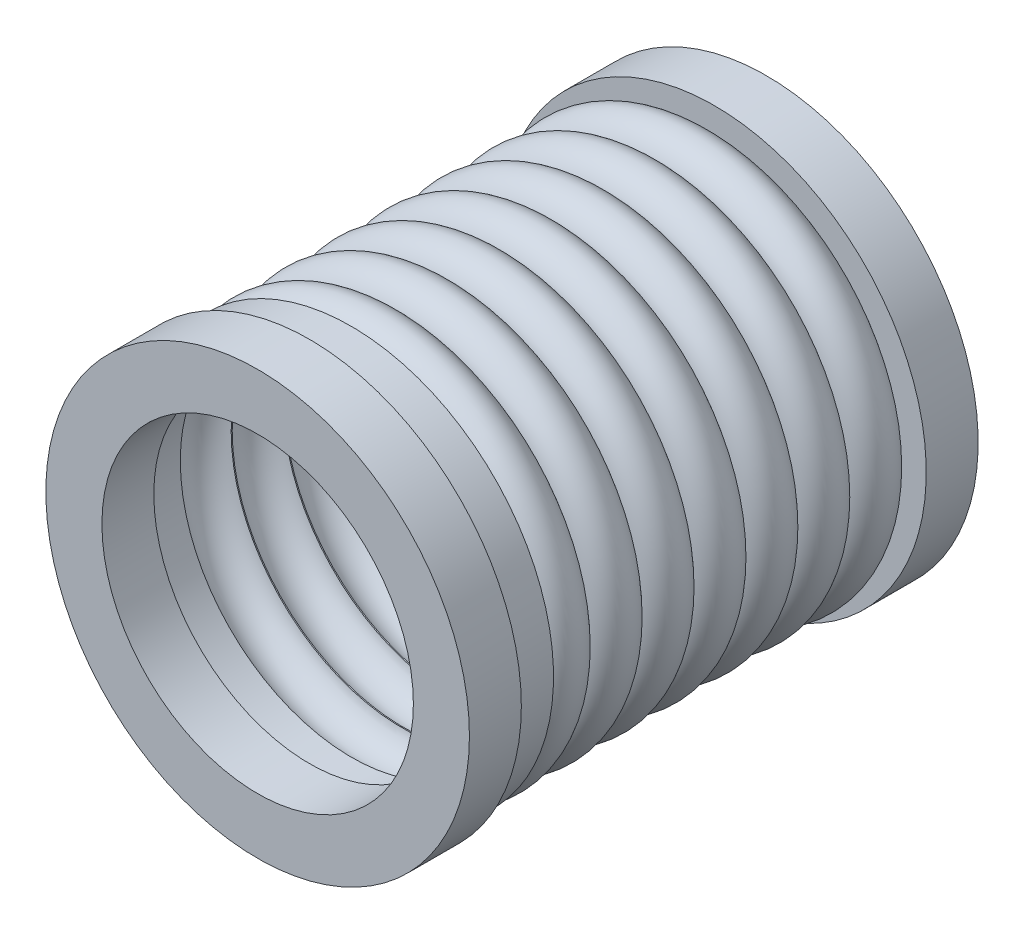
ISO-10303-21;
HEADER;
FILE_DESCRIPTION(('STEP AP214'),'2;1');
FILE_NAME('part.step','',(''),(''),'','','');
FILE_SCHEMA(('AUTOMOTIVE_DESIGN { 1 0 10303 214 1 1 1 1 }'));
ENDSEC;
DATA;
#1=APPLICATION_CONTEXT('core data for automotive mechanical design processes');
#2=APPLICATION_PROTOCOL_DEFINITION('international standard','automotive_design',2000,#1);
#3=PRODUCT_CONTEXT('',#1,'mechanical');
#4=PRODUCT('Part','Part','',(#3));
#5=PRODUCT_RELATED_PRODUCT_CATEGORY('part','',(#4));
#6=PRODUCT_DEFINITION_FORMATION('','',#4);
#7=PRODUCT_DEFINITION_CONTEXT('part definition',#1,'design');
#8=PRODUCT_DEFINITION('design','',#6,#7);
#9=PRODUCT_DEFINITION_SHAPE('','',#8);
#10=(LENGTH_UNIT() NAMED_UNIT(*) SI_UNIT(.MILLI.,.METRE.));
#11=(NAMED_UNIT(*) PLANE_ANGLE_UNIT() SI_UNIT($,.RADIAN.));
#12=(NAMED_UNIT(*) SI_UNIT($,.STERADIAN.) SOLID_ANGLE_UNIT());
#13=UNCERTAINTY_MEASURE_WITH_UNIT(LENGTH_MEASURE(1.E-05),#10,'distance_accuracy_value','');
#14=(GEOMETRIC_REPRESENTATION_CONTEXT(3) GLOBAL_UNCERTAINTY_ASSIGNED_CONTEXT((#13)) GLOBAL_UNIT_ASSIGNED_CONTEXT((#10,
#11,#12)) REPRESENTATION_CONTEXT('',''));
#15=CARTESIAN_POINT('',(0.,0.,0.));
#16=DIRECTION('',(0.,0.,1.));
#17=DIRECTION('',(1.,0.,0.));
#18=AXIS2_PLACEMENT_3D('',#15,#16,#17);
#19=CARTESIAN_POINT('',(0.,0.,24.765));
#20=DIRECTION('',(0.,0.,-1.));
#21=DIRECTION('',(-1.,0.,0.));
#22=AXIS2_PLACEMENT_3D('',#19,#20,#21);
#23=CYLINDRICAL_SURFACE('',#22,10.4775);
#24=CARTESIAN_POINT('',(0.,0.,19.0179259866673));
#25=DIRECTION('',(0.,0.,-1.));
#26=DIRECTION('',(-1.,0.,0.));
#27=AXIS2_PLACEMENT_3D('',#24,#25,#26);
#28=CIRCLE('',#27,10.4775);
#29=CARTESIAN_POINT('',(-10.4775,0.,19.0179259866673));
#30=VERTEX_POINT('',#29);
#31=EDGE_CURVE('E89',#30,#30,#28,.T.);
#32=ORIENTED_EDGE('',*,*,#31,.T.);
#33=EDGE_LOOP('',(#32));
#34=FACE_BOUND('',#33,.T.);
#35=CARTESIAN_POINT('',(0.,0.,19.0820740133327));
#36=DIRECTION('',(0.,0.,1.));
#37=DIRECTION('',(1.,0.,0.));
#38=AXIS2_PLACEMENT_3D('',#35,#36,#37);
#39=CIRCLE('',#38,10.4775);
#40=CARTESIAN_POINT('',(10.4775,0.,19.0820740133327));
#41=VERTEX_POINT('',#40);
#42=EDGE_CURVE('E39',#41,#41,#39,.T.);
#43=ORIENTED_EDGE('',*,*,#42,.T.);
#44=EDGE_LOOP('',(#43));
#45=FACE_BOUND('',#44,.T.);
#46=ADVANCED_FACE('F35',(#34,#45),#23,.F.);
#47=CARTESIAN_POINT('',(0.,0.,24.765));
#48=DIRECTION('',(0.,0.,1.));
#49=DIRECTION('',(1.,0.,0.));
#50=AXIS2_PLACEMENT_3D('',#47,#48,#49);
#51=CIRCLE('',#50,10.4775);
#52=CARTESIAN_POINT('',(10.4775,0.,24.765));
#53=VERTEX_POINT('',#52);
#54=EDGE_CURVE('E435',#53,#53,#51,.T.);
#55=ORIENTED_EDGE('',*,*,#54,.T.);
#56=EDGE_LOOP('',(#55));
#57=FACE_BOUND('',#56,.T.);
#58=CARTESIAN_POINT('',(0.,0.,22.1929259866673));
#59=DIRECTION('',(0.,0.,-1.));
#60=DIRECTION('',(-1.,0.,0.));
#61=AXIS2_PLACEMENT_3D('',#58,#59,#60);
#62=CIRCLE('',#61,10.4775);
#63=CARTESIAN_POINT('',(-10.4775,0.,22.1929259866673));
#64=VERTEX_POINT('',#63);
#65=EDGE_CURVE('E93',#64,#64,#62,.T.);
#66=ORIENTED_EDGE('',*,*,#65,.T.);
#67=EDGE_LOOP('',(#66));
#68=FACE_BOUND('',#67,.T.);
#69=ADVANCED_FACE('F149',(#57,#68),#23,.F.);
#70=CARTESIAN_POINT('',(0.,0.,15.8429259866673));
#71=DIRECTION('',(0.,0.,-1.));
#72=DIRECTION('',(-1.,0.,0.));
#73=AXIS2_PLACEMENT_3D('',#70,#71,#72);
#74=CIRCLE('',#73,10.4775);
#75=CARTESIAN_POINT('',(-10.4775,0.,15.8429259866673));
#76=VERTEX_POINT('',#75);
#77=EDGE_CURVE('E83',#76,#76,#74,.T.);
#78=ORIENTED_EDGE('',*,*,#77,.T.);
#79=EDGE_LOOP('',(#78));
#80=FACE_BOUND('',#79,.T.);
#81=CARTESIAN_POINT('',(0.,0.,15.9070740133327));
#82=DIRECTION('',(0.,0.,1.));
#83=DIRECTION('',(1.,0.,0.));
#84=AXIS2_PLACEMENT_3D('',#81,#82,#83);
#85=CIRCLE('',#84,10.4775);
#86=CARTESIAN_POINT('',(10.4775,0.,15.9070740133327));
#87=VERTEX_POINT('',#86);
#88=EDGE_CURVE('E86',#87,#87,#85,.T.);
#89=ORIENTED_EDGE('',*,*,#88,.T.);
#90=EDGE_LOOP('',(#89));
#91=FACE_BOUND('',#90,.T.);
#92=ADVANCED_FACE('F154',(#80,#91),#23,.F.);
#93=CARTESIAN_POINT('',(0.,0.,12.6679259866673));
#94=DIRECTION('',(0.,0.,-1.));
#95=DIRECTION('',(-1.,0.,0.));
#96=AXIS2_PLACEMENT_3D('',#93,#94,#95);
#97=CIRCLE('',#96,10.4775);
#98=CARTESIAN_POINT('',(-10.4775,0.,12.6679259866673));
#99=VERTEX_POINT('',#98);
#100=EDGE_CURVE('E77',#99,#99,#97,.T.);
#101=ORIENTED_EDGE('',*,*,#100,.T.);
#102=EDGE_LOOP('',(#101));
#103=FACE_BOUND('',#102,.T.);
#104=CARTESIAN_POINT('',(0.,0.,12.7320740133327));
#105=DIRECTION('',(0.,0.,1.));
#106=DIRECTION('',(1.,0.,0.));
#107=AXIS2_PLACEMENT_3D('',#104,#105,#106);
#108=CIRCLE('',#107,10.4775);
#109=CARTESIAN_POINT('',(10.4775,0.,12.7320740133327));
#110=VERTEX_POINT('',#109);
#111=EDGE_CURVE('E80',#110,#110,#108,.T.);
#112=ORIENTED_EDGE('',*,*,#111,.T.);
#113=EDGE_LOOP('',(#112));
#114=FACE_BOUND('',#113,.T.);
#115=ADVANCED_FACE('F198',(#103,#114),#23,.F.);
#116=CARTESIAN_POINT('',(0.,0.,9.49292598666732));
#117=DIRECTION('',(0.,0.,-1.));
#118=DIRECTION('',(-1.,0.,0.));
#119=AXIS2_PLACEMENT_3D('',#116,#117,#118);
#120=CIRCLE('',#119,10.4775);
#121=CARTESIAN_POINT('',(-10.4775,0.,9.49292598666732));
#122=VERTEX_POINT('',#121);
#123=EDGE_CURVE('E71',#122,#122,#120,.T.);
#124=ORIENTED_EDGE('',*,*,#123,.T.);
#125=EDGE_LOOP('',(#124));
#126=FACE_BOUND('',#125,.T.);
#127=CARTESIAN_POINT('',(0.,0.,9.55707401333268));
#128=DIRECTION('',(0.,0.,1.));
#129=DIRECTION('',(1.,0.,0.));
#130=AXIS2_PLACEMENT_3D('',#127,#128,#129);
#131=CIRCLE('',#130,10.4775);
#132=CARTESIAN_POINT('',(10.4775,0.,9.55707401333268));
#133=VERTEX_POINT('',#132);
#134=EDGE_CURVE('E74',#133,#133,#131,.T.);
#135=ORIENTED_EDGE('',*,*,#134,.T.);
#136=EDGE_LOOP('',(#135));
#137=FACE_BOUND('',#136,.T.);
#138=ADVANCED_FACE('F187',(#126,#137),#23,.F.);
#139=CARTESIAN_POINT('',(0.,0.,6.31792598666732));
#140=DIRECTION('',(0.,0.,-1.));
#141=DIRECTION('',(-1.,0.,0.));
#142=AXIS2_PLACEMENT_3D('',#139,#140,#141);
#143=CIRCLE('',#142,10.4775);
#144=CARTESIAN_POINT('',(-10.4775,0.,6.31792598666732));
#145=VERTEX_POINT('',#144);
#146=EDGE_CURVE('E65',#145,#145,#143,.T.);
#147=ORIENTED_EDGE('',*,*,#146,.T.);
#148=EDGE_LOOP('',(#147));
#149=FACE_BOUND('',#148,.T.);
#150=CARTESIAN_POINT('',(0.,0.,6.38207401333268));
#151=DIRECTION('',(0.,0.,1.));
#152=DIRECTION('',(1.,0.,0.));
#153=AXIS2_PLACEMENT_3D('',#150,#151,#152);
#154=CIRCLE('',#153,10.4775);
#155=CARTESIAN_POINT('',(10.4775,0.,6.38207401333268));
#156=VERTEX_POINT('',#155);
#157=EDGE_CURVE('E68',#156,#156,#154,.T.);
#158=ORIENTED_EDGE('',*,*,#157,.T.);
#159=EDGE_LOOP('',(#158));
#160=FACE_BOUND('',#159,.T.);
#161=ADVANCED_FACE('F163',(#149,#160),#23,.F.);
#162=CARTESIAN_POINT('',(0.,0.,3.14292598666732));
#163=DIRECTION('',(0.,0.,-1.));
#164=DIRECTION('',(-1.,0.,0.));
#165=AXIS2_PLACEMENT_3D('',#162,#163,#164);
#166=CIRCLE('',#165,10.4775);
#167=CARTESIAN_POINT('',(-10.4775,0.,3.14292598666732));
#168=VERTEX_POINT('',#167);
#169=EDGE_CURVE('E57',#168,#168,#166,.T.);
#170=ORIENTED_EDGE('',*,*,#169,.T.);
#171=EDGE_LOOP('',(#170));
#172=FACE_BOUND('',#171,.T.);
#173=CARTESIAN_POINT('',(0.,0.,3.20707401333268));
#174=DIRECTION('',(0.,0.,1.));
#175=DIRECTION('',(1.,0.,0.));
#176=AXIS2_PLACEMENT_3D('',#173,#174,#175);
#177=CIRCLE('',#176,10.4775);
#178=CARTESIAN_POINT('',(10.4775,0.,3.20707401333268));
#179=VERTEX_POINT('',#178);
#180=EDGE_CURVE('E61',#179,#179,#177,.T.);
#181=ORIENTED_EDGE('',*,*,#180,.T.);
#182=EDGE_LOOP('',(#181));
#183=FACE_BOUND('',#182,.T.);
#184=ADVANCED_FACE('F158',(#172,#183),#23,.F.);
#185=CARTESIAN_POINT('',(0.,0.,0.));
#186=DIRECTION('',(0.,0.,1.));
#187=DIRECTION('',(1.,0.,0.));
#188=AXIS2_PLACEMENT_3D('',#185,#186,#187);
#189=CIRCLE('',#188,10.4775);
#190=CARTESIAN_POINT('',(10.4775,0.,0.));
#191=VERTEX_POINT('',#190);
#192=EDGE_CURVE('E43',#191,#191,#189,.T.);
#193=ORIENTED_EDGE('',*,*,#192,.F.);
#194=EDGE_LOOP('',(#193));
#195=FACE_BOUND('',#194,.T.);
#196=CARTESIAN_POINT('',(0.,0.,0.0320740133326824));
#197=DIRECTION('',(0.,0.,1.));
#198=DIRECTION('',(1.,0.,0.));
#199=AXIS2_PLACEMENT_3D('',#196,#197,#198);
#200=CIRCLE('',#199,10.4775);
#201=CARTESIAN_POINT('',(10.4775,0.,0.0320740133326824));
#202=VERTEX_POINT('',#201);
#203=EDGE_CURVE('E60',#202,#202,#200,.T.);
#204=ORIENTED_EDGE('',*,*,#203,.T.);
#205=EDGE_LOOP('',(#204));
#206=FACE_BOUND('',#205,.T.);
#207=ADVANCED_FACE('F146',(#195,#206),#23,.F.);
#208=CARTESIAN_POINT('',(0.,0.,24.765));
#209=DIRECTION('',(0.,0.,-1.));
#210=DIRECTION('',(-1.,0.,0.));
#211=AXIS2_PLACEMENT_3D('',#208,#209,#210);
#212=CYLINDRICAL_SURFACE('',#211,12.3825);
#213=CARTESIAN_POINT('',(0.,0.,24.765));
#214=DIRECTION('',(0.,0.,1.));
#215=DIRECTION('',(1.,0.,0.));
#216=AXIS2_PLACEMENT_3D('',#213,#214,#215);
#217=CIRCLE('',#216,12.3825);
#218=CARTESIAN_POINT('',(12.3825,0.,24.765));
#219=VERTEX_POINT('',#218);
#220=EDGE_CURVE('E10',#219,#219,#217,.T.);
#221=ORIENTED_EDGE('',*,*,#220,.F.);
#222=EDGE_LOOP('',(#221));
#223=FACE_BOUND('',#222,.T.);
#224=CARTESIAN_POINT('',(0.,0.,22.225));
#225=DIRECTION('',(0.,0.,-1.));
#226=DIRECTION('',(-1.,0.,0.));
#227=AXIS2_PLACEMENT_3D('',#224,#225,#226);
#228=CIRCLE('',#227,12.3825);
#229=CARTESIAN_POINT('',(-12.3825,0.,22.225));
#230=VERTEX_POINT('',#229);
#231=EDGE_CURVE('E52',#230,#230,#228,.T.);
#232=ORIENTED_EDGE('',*,*,#231,.F.);
#233=EDGE_LOOP('',(#232));
#234=FACE_BOUND('',#233,.T.);
#235=ADVANCED_FACE('F37',(#223,#234),#212,.T.);
#236=CARTESIAN_POINT('',(0.,0.,1.5875));
#237=DIRECTION('',(0.,0.,-1.));
#238=DIRECTION('',(-1.,0.,0.));
#239=AXIS2_PLACEMENT_3D('',#236,#237,#238);
#240=TOROIDAL_SURFACE('',#239,10.795,1.5875);
#241=CARTESIAN_POINT('',(0.,0.,3.175));
#242=DIRECTION('',(0.,0.,-1.));
#243=DIRECTION('',(-1.,0.,0.));
#244=AXIS2_PLACEMENT_3D('',#241,#242,#243);
#245=CIRCLE('',#244,10.795);
#246=CARTESIAN_POINT('',(-10.795,0.,3.175));
#247=VERTEX_POINT('',#246);
#248=EDGE_CURVE('E126',#247,#247,#245,.T.);
#249=ORIENTED_EDGE('',*,*,#248,.T.);
#250=EDGE_LOOP('',(#249));
#251=FACE_BOUND('',#250,.T.);
#252=CARTESIAN_POINT('',(0.,0.,0.));
#253=DIRECTION('',(0.,0.,-1.));
#254=DIRECTION('',(-1.,0.,0.));
#255=AXIS2_PLACEMENT_3D('',#252,#253,#254);
#256=CIRCLE('',#255,10.795);
#257=CARTESIAN_POINT('',(-10.795,0.,0.));
#258=VERTEX_POINT('',#257);
#259=EDGE_CURVE('E48',#258,#258,#256,.T.);
#260=ORIENTED_EDGE('',*,*,#259,.F.);
#261=EDGE_LOOP('',(#260));
#262=FACE_BOUND('',#261,.T.);
#263=ADVANCED_FACE('F134',(#251,#262),#240,.T.);
#264=CARTESIAN_POINT('',(0.,0.,4.7625));
#265=DIRECTION('',(0.,0.,-1.));
#266=DIRECTION('',(-1.,0.,0.));
#267=AXIS2_PLACEMENT_3D('',#264,#265,#266);
#268=TOROIDAL_SURFACE('',#267,10.795,1.5875);
#269=CARTESIAN_POINT('',(0.,0.,6.35));
#270=DIRECTION('',(0.,0.,-1.));
#271=DIRECTION('',(-1.,0.,0.));
#272=AXIS2_PLACEMENT_3D('',#269,#270,#271);
#273=CIRCLE('',#272,10.795);
#274=CARTESIAN_POINT('',(-10.795,0.,6.35));
#275=VERTEX_POINT('',#274);
#276=EDGE_CURVE('E123',#275,#275,#273,.T.);
#277=ORIENTED_EDGE('',*,*,#276,.T.);
#278=EDGE_LOOP('',(#277));
#279=FACE_BOUND('',#278,.T.);
#280=ORIENTED_EDGE('',*,*,#248,.F.);
#281=EDGE_LOOP('',(#280));
#282=FACE_BOUND('',#281,.T.);
#283=ADVANCED_FACE('F136',(#279,#282),#268,.T.);
#284=CARTESIAN_POINT('',(0.,0.,7.9375));
#285=DIRECTION('',(0.,0.,-1.));
#286=DIRECTION('',(-1.,0.,0.));
#287=AXIS2_PLACEMENT_3D('',#284,#285,#286);
#288=TOROIDAL_SURFACE('',#287,10.795,1.5875);
#289=CARTESIAN_POINT('',(0.,0.,9.525));
#290=DIRECTION('',(0.,0.,-1.));
#291=DIRECTION('',(-1.,0.,0.));
#292=AXIS2_PLACEMENT_3D('',#289,#290,#291);
#293=CIRCLE('',#292,10.795);
#294=CARTESIAN_POINT('',(-10.795,0.,9.525));
#295=VERTEX_POINT('',#294);
#296=EDGE_CURVE('E120',#295,#295,#293,.T.);
#297=ORIENTED_EDGE('',*,*,#296,.T.);
#298=EDGE_LOOP('',(#297));
#299=FACE_BOUND('',#298,.T.);
#300=ORIENTED_EDGE('',*,*,#276,.F.);
#301=EDGE_LOOP('',(#300));
#302=FACE_BOUND('',#301,.T.);
#303=ADVANCED_FACE('F143',(#299,#302),#288,.T.);
#304=CARTESIAN_POINT('',(0.,0.,11.1125));
#305=DIRECTION('',(0.,0.,-1.));
#306=DIRECTION('',(-1.,0.,0.));
#307=AXIS2_PLACEMENT_3D('',#304,#305,#306);
#308=TOROIDAL_SURFACE('',#307,10.795,1.5875);
#309=CARTESIAN_POINT('',(0.,0.,12.7));
#310=DIRECTION('',(0.,0.,-1.));
#311=DIRECTION('',(-1.,0.,0.));
#312=AXIS2_PLACEMENT_3D('',#309,#310,#311);
#313=CIRCLE('',#312,10.795);
#314=CARTESIAN_POINT('',(-10.795,0.,12.7));
#315=VERTEX_POINT('',#314);
#316=EDGE_CURVE('E117',#315,#315,#313,.T.);
#317=ORIENTED_EDGE('',*,*,#316,.T.);
#318=EDGE_LOOP('',(#317));
#319=FACE_BOUND('',#318,.T.);
#320=ORIENTED_EDGE('',*,*,#296,.F.);
#321=EDGE_LOOP('',(#320));
#322=FACE_BOUND('',#321,.T.);
#323=ADVANCED_FACE('F248',(#319,#322),#308,.T.);
#324=CARTESIAN_POINT('',(0.,0.,14.2875));
#325=DIRECTION('',(0.,0.,-1.));
#326=DIRECTION('',(-1.,0.,0.));
#327=AXIS2_PLACEMENT_3D('',#324,#325,#326);
#328=TOROIDAL_SURFACE('',#327,10.795,1.5875);
#329=CARTESIAN_POINT('',(0.,0.,15.875));
#330=DIRECTION('',(0.,0.,-1.));
#331=DIRECTION('',(-1.,0.,0.));
#332=AXIS2_PLACEMENT_3D('',#329,#330,#331);
#333=CIRCLE('',#332,10.795);
#334=CARTESIAN_POINT('',(-10.795,0.,15.875));
#335=VERTEX_POINT('',#334);
#336=EDGE_CURVE('E55',#335,#335,#333,.T.);
#337=ORIENTED_EDGE('',*,*,#336,.T.);
#338=EDGE_LOOP('',(#337));
#339=FACE_BOUND('',#338,.T.);
#340=ORIENTED_EDGE('',*,*,#316,.F.);
#341=EDGE_LOOP('',(#340));
#342=FACE_BOUND('',#341,.T.);
#343=ADVANCED_FACE('F244',(#339,#342),#328,.T.);
#344=CARTESIAN_POINT('',(0.,0.,17.4625));
#345=DIRECTION('',(0.,0.,-1.));
#346=DIRECTION('',(-1.,0.,0.));
#347=AXIS2_PLACEMENT_3D('',#344,#345,#346);
#348=TOROIDAL_SURFACE('',#347,10.795,1.5875);
#349=CARTESIAN_POINT('',(0.,0.,19.05));
#350=DIRECTION('',(0.,0.,-1.));
#351=DIRECTION('',(-1.,0.,0.));
#352=AXIS2_PLACEMENT_3D('',#349,#350,#351);
#353=CIRCLE('',#352,10.795);
#354=CARTESIAN_POINT('',(-10.795,0.,19.05));
#355=VERTEX_POINT('',#354);
#356=EDGE_CURVE('E64',#355,#355,#353,.T.);
#357=ORIENTED_EDGE('',*,*,#356,.T.);
#358=EDGE_LOOP('',(#357));
#359=FACE_BOUND('',#358,.T.);
#360=ORIENTED_EDGE('',*,*,#336,.F.);
#361=EDGE_LOOP('',(#360));
#362=FACE_BOUND('',#361,.T.);
#363=ADVANCED_FACE('F237',(#359,#362),#348,.T.);
#364=CARTESIAN_POINT('',(10.795,0.,22.225));
#365=DIRECTION('',(0.,0.,-1.));
#366=DIRECTION('',(-1.,0.,0.));
#367=AXIS2_PLACEMENT_3D('',#364,#365,#366);
#368=PLANE('',#367);
#369=CARTESIAN_POINT('',(0.,0.,22.225));
#370=DIRECTION('',(0.,0.,-1.));
#371=DIRECTION('',(-1.,0.,0.));
#372=AXIS2_PLACEMENT_3D('',#369,#370,#371);
#373=CIRCLE('',#372,10.795);
#374=CARTESIAN_POINT('',(-10.795,0.,22.225));
#375=VERTEX_POINT('',#374);
#376=EDGE_CURVE('E56',#375,#375,#373,.T.);
#377=ORIENTED_EDGE('',*,*,#376,.F.);
#378=EDGE_LOOP('',(#377));
#379=FACE_BOUND('',#378,.T.);
#380=ORIENTED_EDGE('',*,*,#231,.T.);
#381=EDGE_LOOP('',(#380));
#382=FACE_BOUND('',#381,.T.);
#383=ADVANCED_FACE('F234',(#379,#382),#368,.T.);
#384=CARTESIAN_POINT('',(0.,0.,20.6375));
#385=DIRECTION('',(0.,0.,-1.));
#386=DIRECTION('',(-1.,0.,0.));
#387=AXIS2_PLACEMENT_3D('',#384,#385,#386);
#388=TOROIDAL_SURFACE('',#387,10.795,1.5875);
#389=ORIENTED_EDGE('',*,*,#376,.T.);
#390=EDGE_LOOP('',(#389));
#391=FACE_BOUND('',#390,.T.);
#392=ORIENTED_EDGE('',*,*,#356,.F.);
#393=EDGE_LOOP('',(#392));
#394=FACE_BOUND('',#393,.T.);
#395=ADVANCED_FACE('F173',(#391,#394),#388,.T.);
#396=CARTESIAN_POINT('',(0.,0.,1.5875));
#397=DIRECTION('',(0.,0.,-1.));
#398=DIRECTION('',(-1.,0.,0.));
#399=AXIS2_PLACEMENT_3D('',#396,#397,#398);
#400=TOROIDAL_SURFACE('',#399,10.16,1.5875);
#401=ORIENTED_EDGE('',*,*,#203,.F.);
#402=EDGE_LOOP('',(#401));
#403=FACE_BOUND('',#402,.T.);
#404=ORIENTED_EDGE('',*,*,#169,.F.);
#405=EDGE_LOOP('',(#404));
#406=FACE_BOUND('',#405,.T.);
#407=ADVANCED_FACE('F169',(#403,#406),#400,.F.);
#408=CARTESIAN_POINT('',(0.,0.,4.7625));
#409=DIRECTION('',(0.,0.,-1.));
#410=DIRECTION('',(-1.,0.,0.));
#411=AXIS2_PLACEMENT_3D('',#408,#409,#410);
#412=TOROIDAL_SURFACE('',#411,10.16,1.5875);
#413=ORIENTED_EDGE('',*,*,#180,.F.);
#414=EDGE_LOOP('',(#413));
#415=FACE_BOUND('',#414,.T.);
#416=ORIENTED_EDGE('',*,*,#146,.F.);
#417=EDGE_LOOP('',(#416));
#418=FACE_BOUND('',#417,.T.);
#419=ADVANCED_FACE('F172',(#415,#418),#412,.F.);
#420=CARTESIAN_POINT('',(0.,0.,7.9375));
#421=DIRECTION('',(0.,0.,-1.));
#422=DIRECTION('',(-1.,0.,0.));
#423=AXIS2_PLACEMENT_3D('',#420,#421,#422);
#424=TOROIDAL_SURFACE('',#423,10.16,1.5875);
#425=ORIENTED_EDGE('',*,*,#157,.F.);
#426=EDGE_LOOP('',(#425));
#427=FACE_BOUND('',#426,.T.);
#428=ORIENTED_EDGE('',*,*,#123,.F.);
#429=EDGE_LOOP('',(#428));
#430=FACE_BOUND('',#429,.T.);
#431=ADVANCED_FACE('F181',(#427,#430),#424,.F.);
#432=CARTESIAN_POINT('',(0.,0.,11.1125));
#433=DIRECTION('',(0.,0.,-1.));
#434=DIRECTION('',(-1.,0.,0.));
#435=AXIS2_PLACEMENT_3D('',#432,#433,#434);
#436=TOROIDAL_SURFACE('',#435,10.16,1.5875);
#437=ORIENTED_EDGE('',*,*,#134,.F.);
#438=EDGE_LOOP('',(#437));
#439=FACE_BOUND('',#438,.T.);
#440=ORIENTED_EDGE('',*,*,#100,.F.);
#441=EDGE_LOOP('',(#440));
#442=FACE_BOUND('',#441,.T.);
#443=ADVANCED_FACE('F192',(#439,#442),#436,.F.);
#444=CARTESIAN_POINT('',(0.,0.,14.2875));
#445=DIRECTION('',(0.,0.,-1.));
#446=DIRECTION('',(-1.,0.,0.));
#447=AXIS2_PLACEMENT_3D('',#444,#445,#446);
#448=TOROIDAL_SURFACE('',#447,10.16,1.5875);
#449=ORIENTED_EDGE('',*,*,#111,.F.);
#450=EDGE_LOOP('',(#449));
#451=FACE_BOUND('',#450,.T.);
#452=ORIENTED_EDGE('',*,*,#77,.F.);
#453=EDGE_LOOP('',(#452));
#454=FACE_BOUND('',#453,.T.);
#455=ADVANCED_FACE('F203',(#451,#454),#448,.F.);
#456=CARTESIAN_POINT('',(0.,0.,17.4625));
#457=DIRECTION('',(0.,0.,-1.));
#458=DIRECTION('',(-1.,0.,0.));
#459=AXIS2_PLACEMENT_3D('',#456,#457,#458);
#460=TOROIDAL_SURFACE('',#459,10.16,1.5875);
#461=ORIENTED_EDGE('',*,*,#88,.F.);
#462=EDGE_LOOP('',(#461));
#463=FACE_BOUND('',#462,.T.);
#464=ORIENTED_EDGE('',*,*,#31,.F.);
#465=EDGE_LOOP('',(#464));
#466=FACE_BOUND('',#465,.T.);
#467=ADVANCED_FACE('F213',(#463,#466),#460,.F.);
#468=CARTESIAN_POINT('',(0.,0.,20.6375));
#469=DIRECTION('',(0.,0.,-1.));
#470=DIRECTION('',(-1.,0.,0.));
#471=AXIS2_PLACEMENT_3D('',#468,#469,#470);
#472=TOROIDAL_SURFACE('',#471,10.16,1.5875);
#473=ORIENTED_EDGE('',*,*,#42,.F.);
#474=EDGE_LOOP('',(#473));
#475=FACE_BOUND('',#474,.T.);
#476=ORIENTED_EDGE('',*,*,#65,.F.);
#477=EDGE_LOOP('',(#476));
#478=FACE_BOUND('',#477,.T.);
#479=ADVANCED_FACE('F223',(#475,#478),#472,.F.);
#480=CARTESIAN_POINT('',(0.,0.,0.));
#481=DIRECTION('',(0.,0.,-1.));
#482=DIRECTION('',(-1.,0.,0.));
#483=AXIS2_PLACEMENT_3D('',#480,#481,#482);
#484=PLANE('',#483);
#485=ORIENTED_EDGE('',*,*,#192,.T.);
#486=EDGE_LOOP('',(#485));
#487=FACE_BOUND('',#486,.T.);
#488=CARTESIAN_POINT('',(0.,0.,0.));
#489=DIRECTION('',(0.,0.,-1.));
#490=DIRECTION('',(-1.,0.,0.));
#491=AXIS2_PLACEMENT_3D('',#488,#489,#490);
#492=CIRCLE('',#491,9.525);
#493=CARTESIAN_POINT('',(-9.525,0.,0.));
#494=VERTEX_POINT('',#493);
#495=EDGE_CURVE('E108',#494,#494,#492,.T.);
#496=ORIENTED_EDGE('',*,*,#495,.T.);
#497=EDGE_LOOP('',(#496));
#498=FACE_BOUND('',#497,.T.);
#499=ADVANCED_FACE('F229',(#487,#498),#484,.F.);
#500=CARTESIAN_POINT('',(0.,0.,-3.175));
#501=DIRECTION('',(0.,0.,-1.));
#502=DIRECTION('',(-1.,0.,0.));
#503=AXIS2_PLACEMENT_3D('',#500,#501,#502);
#504=PLANE('',#503);
#505=CARTESIAN_POINT('',(0.,0.,-3.175));
#506=DIRECTION('',(0.,0.,-1.));
#507=DIRECTION('',(-1.,0.,0.));
#508=AXIS2_PLACEMENT_3D('',#505,#506,#507);
#509=CIRCLE('',#508,12.954);
#510=CARTESIAN_POINT('',(-12.954,0.,-3.175));
#511=VERTEX_POINT('',#510);
#512=EDGE_CURVE('E95',#511,#511,#509,.T.);
#513=ORIENTED_EDGE('',*,*,#512,.T.);
#514=EDGE_LOOP('',(#513));
#515=FACE_BOUND('',#514,.T.);
#516=CARTESIAN_POINT('',(0.,0.,-3.175));
#517=DIRECTION('',(0.,0.,-1.));
#518=DIRECTION('',(-1.,0.,0.));
#519=AXIS2_PLACEMENT_3D('',#516,#517,#518);
#520=CIRCLE('',#519,9.525);
#521=CARTESIAN_POINT('',(-9.525,0.,-3.175));
#522=VERTEX_POINT('',#521);
#523=EDGE_CURVE('E105',#522,#522,#520,.T.);
#524=ORIENTED_EDGE('',*,*,#523,.F.);
#525=EDGE_LOOP('',(#524));
#526=FACE_BOUND('',#525,.T.);
#527=ADVANCED_FACE('F332',(#515,#526),#504,.T.);
#528=ORIENTED_EDGE('',*,*,#259,.T.);
#529=EDGE_LOOP('',(#528));
#530=FACE_BOUND('',#529,.T.);
#531=CARTESIAN_POINT('',(0.,0.,0.));
#532=DIRECTION('',(0.,0.,-1.));
#533=DIRECTION('',(-1.,0.,0.));
#534=AXIS2_PLACEMENT_3D('',#531,#532,#533);
#535=CIRCLE('',#534,12.954);
#536=CARTESIAN_POINT('',(-12.954,0.,0.));
#537=VERTEX_POINT('',#536);
#538=EDGE_CURVE('E100',#537,#537,#535,.T.);
#539=ORIENTED_EDGE('',*,*,#538,.F.);
#540=EDGE_LOOP('',(#539));
#541=FACE_BOUND('',#540,.T.);
#542=ADVANCED_FACE('F131',(#530,#541),#484,.F.);
#543=CARTESIAN_POINT('',(0.,0.,-3.175));
#544=DIRECTION('',(0.,0.,1.));
#545=DIRECTION('',(1.,0.,0.));
#546=AXIS2_PLACEMENT_3D('',#543,#544,#545);
#547=CYLINDRICAL_SURFACE('',#546,12.954);
#548=ORIENTED_EDGE('',*,*,#512,.F.);
#549=EDGE_LOOP('',(#548));
#550=FACE_BOUND('',#549,.T.);
#551=ORIENTED_EDGE('',*,*,#538,.T.);
#552=EDGE_LOOP('',(#551));
#553=FACE_BOUND('',#552,.T.);
#554=ADVANCED_FACE('F350',(#550,#553),#547,.T.);
#555=CARTESIAN_POINT('',(0.,0.,-3.175));
#556=DIRECTION('',(0.,0.,1.));
#557=DIRECTION('',(1.,0.,0.));
#558=AXIS2_PLACEMENT_3D('',#555,#556,#557);
#559=CYLINDRICAL_SURFACE('',#558,9.525);
#560=ORIENTED_EDGE('',*,*,#523,.T.);
#561=EDGE_LOOP('',(#560));
#562=FACE_BOUND('',#561,.T.);
#563=ORIENTED_EDGE('',*,*,#495,.F.);
#564=EDGE_LOOP('',(#563));
#565=FACE_BOUND('',#564,.T.);
#566=ADVANCED_FACE('F358',(#562,#565),#559,.F.);
#567=CARTESIAN_POINT('',(0.,0.,24.765));
#568=DIRECTION('',(0.,0.,1.));
#569=DIRECTION('',(1.,0.,0.));
#570=AXIS2_PLACEMENT_3D('',#567,#568,#569);
#571=PLANE('',#570);
#572=CARTESIAN_POINT('',(0.,0.,24.765));
#573=DIRECTION('',(0.,0.,1.));
#574=DIRECTION('',(1.,0.,0.));
#575=AXIS2_PLACEMENT_3D('',#572,#573,#574);
#576=CIRCLE('',#575,12.954);
#577=CARTESIAN_POINT('',(12.954,0.,24.765));
#578=VERTEX_POINT('',#577);
#579=EDGE_CURVE('E429',#578,#578,#576,.T.);
#580=ORIENTED_EDGE('',*,*,#579,.F.);
#581=EDGE_LOOP('',(#580));
#582=FACE_BOUND('',#581,.T.);
#583=ORIENTED_EDGE('',*,*,#220,.T.);
#584=EDGE_LOOP('',(#583));
#585=FACE_BOUND('',#584,.T.);
#586=ADVANCED_FACE('F367',(#582,#585),#571,.F.);
#587=CARTESIAN_POINT('',(0.,0.,27.94));
#588=DIRECTION('',(0.,0.,1.));
#589=DIRECTION('',(1.,0.,0.));
#590=AXIS2_PLACEMENT_3D('',#587,#588,#589);
#591=PLANE('',#590);
#592=CARTESIAN_POINT('',(0.,0.,27.94));
#593=DIRECTION('',(0.,0.,1.));
#594=DIRECTION('',(1.,0.,0.));
#595=AXIS2_PLACEMENT_3D('',#592,#593,#594);
#596=CIRCLE('',#595,12.954);
#597=CARTESIAN_POINT('',(12.954,0.,27.94));
#598=VERTEX_POINT('',#597);
#599=EDGE_CURVE('E432',#598,#598,#596,.T.);
#600=ORIENTED_EDGE('',*,*,#599,.T.);
#601=EDGE_LOOP('',(#600));
#602=FACE_BOUND('',#601,.T.);
#603=CARTESIAN_POINT('',(0.,0.,27.94));
#604=DIRECTION('',(0.,0.,1.));
#605=DIRECTION('',(1.,0.,0.));
#606=AXIS2_PLACEMENT_3D('',#603,#604,#605);
#607=CIRCLE('',#606,9.525);
#608=CARTESIAN_POINT('',(9.525,0.,27.94));
#609=VERTEX_POINT('',#608);
#610=EDGE_CURVE('E423',#609,#609,#607,.T.);
#611=ORIENTED_EDGE('',*,*,#610,.F.);
#612=EDGE_LOOP('',(#611));
#613=FACE_BOUND('',#612,.T.);
#614=ADVANCED_FACE('F377',(#602,#613),#591,.T.);
#615=ORIENTED_EDGE('',*,*,#54,.F.);
#616=EDGE_LOOP('',(#615));
#617=FACE_BOUND('',#616,.T.);
#618=CARTESIAN_POINT('',(0.,0.,24.765));
#619=DIRECTION('',(0.,0.,1.));
#620=DIRECTION('',(1.,0.,0.));
#621=AXIS2_PLACEMENT_3D('',#618,#619,#620);
#622=CIRCLE('',#621,9.525);
#623=CARTESIAN_POINT('',(9.525,0.,24.765));
#624=VERTEX_POINT('',#623);
#625=EDGE_CURVE('E426',#624,#624,#622,.T.);
#626=ORIENTED_EDGE('',*,*,#625,.T.);
#627=EDGE_LOOP('',(#626));
#628=FACE_BOUND('',#627,.T.);
#629=ADVANCED_FACE('F380',(#617,#628),#571,.F.);
#630=CARTESIAN_POINT('',(0.,0.,27.94));
#631=DIRECTION('',(0.,0.,-1.));
#632=DIRECTION('',(-1.,0.,0.));
#633=AXIS2_PLACEMENT_3D('',#630,#631,#632);
#634=CYLINDRICAL_SURFACE('',#633,12.954);
#635=ORIENTED_EDGE('',*,*,#599,.F.);
#636=EDGE_LOOP('',(#635));
#637=FACE_BOUND('',#636,.T.);
#638=ORIENTED_EDGE('',*,*,#579,.T.);
#639=EDGE_LOOP('',(#638));
#640=FACE_BOUND('',#639,.T.);
#641=ADVANCED_FACE('F397',(#637,#640),#634,.T.);
#642=CARTESIAN_POINT('',(0.,0.,27.94));
#643=DIRECTION('',(0.,0.,-1.));
#644=DIRECTION('',(-1.,0.,0.));
#645=AXIS2_PLACEMENT_3D('',#642,#643,#644);
#646=CYLINDRICAL_SURFACE('',#645,9.525);
#647=ORIENTED_EDGE('',*,*,#610,.T.);
#648=EDGE_LOOP('',(#647));
#649=FACE_BOUND('',#648,.T.);
#650=ORIENTED_EDGE('',*,*,#625,.F.);
#651=EDGE_LOOP('',(#650));
#652=FACE_BOUND('',#651,.T.);
#653=ADVANCED_FACE('F406',(#649,#652),#646,.F.);
#654=CLOSED_SHELL('',(#46,#69,#92,#115,#138,#161,#184,#207,#235,#263,#283,#303,#323,#343,#363,
#383,#395,#407,#419,#431,#443,#455,#467,#479,#499,#527,#542,#554,#566,#586,#614,#629,#641,#653));
#655=MANIFOLD_SOLID_BREP('B2',#654);
#656=ADVANCED_BREP_SHAPE_REPRESENTATION('',(#18,#655),#14);
#657=SHAPE_DEFINITION_REPRESENTATION(#9,#656);
ENDSEC;
END-ISO-10303-21;
